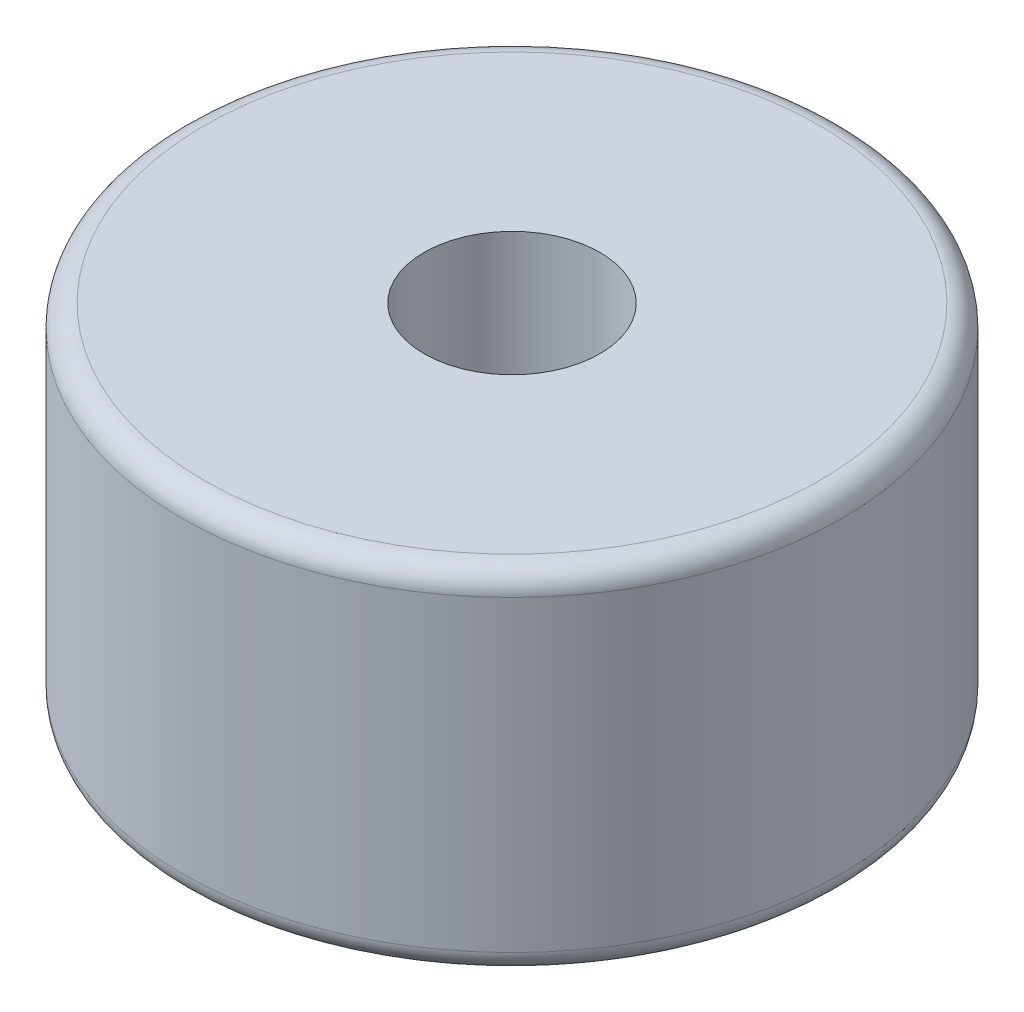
ISO-10303-21;
HEADER;
FILE_DESCRIPTION(('STEP AP214'),'2;1');
FILE_NAME('part.step','',(''),(''),'','','');
FILE_SCHEMA(('AUTOMOTIVE_DESIGN { 1 0 10303 214 1 1 1 1 }'));
ENDSEC;
DATA;
#1=APPLICATION_CONTEXT('core data for automotive mechanical design processes');
#2=APPLICATION_PROTOCOL_DEFINITION('international standard','automotive_design',2000,#1);
#3=PRODUCT_CONTEXT('',#1,'mechanical');
#4=PRODUCT('Part','Part','',(#3));
#5=PRODUCT_RELATED_PRODUCT_CATEGORY('part','',(#4));
#6=PRODUCT_DEFINITION_FORMATION('','',#4);
#7=PRODUCT_DEFINITION_CONTEXT('part definition',#1,'design');
#8=PRODUCT_DEFINITION('design','',#6,#7);
#9=PRODUCT_DEFINITION_SHAPE('','',#8);
#10=(LENGTH_UNIT() NAMED_UNIT(*) SI_UNIT(.MILLI.,.METRE.));
#11=(NAMED_UNIT(*) PLANE_ANGLE_UNIT() SI_UNIT($,.RADIAN.));
#12=(NAMED_UNIT(*) SI_UNIT($,.STERADIAN.) SOLID_ANGLE_UNIT());
#13=UNCERTAINTY_MEASURE_WITH_UNIT(LENGTH_MEASURE(1.E-05),#10,'distance_accuracy_value','');
#14=(GEOMETRIC_REPRESENTATION_CONTEXT(3) GLOBAL_UNCERTAINTY_ASSIGNED_CONTEXT((#13)) GLOBAL_UNIT_ASSIGNED_CONTEXT((#10,
#11,#12)) REPRESENTATION_CONTEXT('',''));
#15=CARTESIAN_POINT('',(0.,0.,0.));
#16=DIRECTION('',(0.,0.,1.));
#17=DIRECTION('',(1.,0.,0.));
#18=AXIS2_PLACEMENT_3D('',#15,#16,#17);
#19=CARTESIAN_POINT('',(0.,8.,0.));
#20=DIRECTION('',(0.,1.,0.));
#21=DIRECTION('',(0.,0.,1.));
#22=AXIS2_PLACEMENT_3D('',#19,#20,#21);
#23=PLANE('',#22);
#24=CARTESIAN_POINT('',(0.,8.,0.));
#25=DIRECTION('',(0.,1.,0.));
#26=DIRECTION('',(0.,0.,1.));
#27=AXIS2_PLACEMENT_3D('',#24,#25,#26);
#28=CIRCLE('',#27,7.);
#29=CARTESIAN_POINT('',(0.,8.,7.));
#30=VERTEX_POINT('',#29);
#31=EDGE_CURVE('E10',#30,#30,#28,.T.);
#32=ORIENTED_EDGE('',*,*,#31,.T.);
#33=EDGE_LOOP('',(#32));
#34=FACE_BOUND('',#33,.T.);
#35=CARTESIAN_POINT('',(0.,8.,0.));
#36=DIRECTION('',(0.,1.,0.));
#37=DIRECTION('',(0.,0.,1.));
#38=AXIS2_PLACEMENT_3D('',#35,#36,#37);
#39=CIRCLE('',#38,2.);
#40=CARTESIAN_POINT('',(0.,8.,2.));
#41=VERTEX_POINT('',#40);
#42=EDGE_CURVE('E61',#41,#41,#39,.T.);
#43=ORIENTED_EDGE('',*,*,#42,.F.);
#44=EDGE_LOOP('',(#43));
#45=FACE_BOUND('',#44,.T.);
#46=ADVANCED_FACE('F41',(#34,#45),#23,.T.);
#47=CARTESIAN_POINT('',(0.,0.,0.));
#48=DIRECTION('',(0.,1.,0.));
#49=DIRECTION('',(0.,0.,1.));
#50=AXIS2_PLACEMENT_3D('',#47,#48,#49);
#51=PLANE('',#50);
#52=CARTESIAN_POINT('',(0.,0.,0.));
#53=DIRECTION('',(0.,1.,0.));
#54=DIRECTION('',(0.,0.,1.));
#55=AXIS2_PLACEMENT_3D('',#52,#53,#54);
#56=CIRCLE('',#55,7.);
#57=CARTESIAN_POINT('',(0.,0.,7.));
#58=VERTEX_POINT('',#57);
#59=EDGE_CURVE('E48',#58,#58,#56,.F.);
#60=ORIENTED_EDGE('',*,*,#59,.T.);
#61=EDGE_LOOP('',(#60));
#62=FACE_BOUND('',#61,.T.);
#63=CARTESIAN_POINT('',(0.,0.,0.));
#64=DIRECTION('',(0.,1.,0.));
#65=DIRECTION('',(0.,0.,1.));
#66=AXIS2_PLACEMENT_3D('',#63,#64,#65);
#67=CIRCLE('',#66,2.);
#68=CARTESIAN_POINT('',(0.,0.,2.));
#69=VERTEX_POINT('',#68);
#70=EDGE_CURVE('E62',#69,#69,#67,.T.);
#71=ORIENTED_EDGE('',*,*,#70,.T.);
#72=EDGE_LOOP('',(#71));
#73=FACE_BOUND('',#72,.T.);
#74=ADVANCED_FACE('F72',(#62,#73),#51,.F.);
#75=CARTESIAN_POINT('',(0.,8.,0.));
#76=DIRECTION('',(0.,-1.,0.));
#77=DIRECTION('',(0.,0.,-1.));
#78=AXIS2_PLACEMENT_3D('',#75,#76,#77);
#79=CYLINDRICAL_SURFACE('',#78,7.5);
#80=CARTESIAN_POINT('',(0.,0.5,0.));
#81=DIRECTION('',(0.,1.,0.));
#82=DIRECTION('',(0.,0.,1.));
#83=AXIS2_PLACEMENT_3D('',#80,#81,#82);
#84=CIRCLE('',#83,7.5);
#85=CARTESIAN_POINT('',(0.,0.5,7.5));
#86=VERTEX_POINT('',#85);
#87=EDGE_CURVE('E52',#86,#86,#84,.T.);
#88=ORIENTED_EDGE('',*,*,#87,.T.);
#89=EDGE_LOOP('',(#88));
#90=FACE_BOUND('',#89,.T.);
#91=CARTESIAN_POINT('',(0.,7.5,0.));
#92=DIRECTION('',(0.,1.,0.));
#93=DIRECTION('',(0.,0.,1.));
#94=AXIS2_PLACEMENT_3D('',#91,#92,#93);
#95=CIRCLE('',#94,7.5);
#96=CARTESIAN_POINT('',(0.,7.5,7.5));
#97=VERTEX_POINT('',#96);
#98=EDGE_CURVE('E56',#97,#97,#95,.F.);
#99=ORIENTED_EDGE('',*,*,#98,.T.);
#100=EDGE_LOOP('',(#99));
#101=FACE_BOUND('',#100,.T.);
#102=ADVANCED_FACE('F77',(#90,#101),#79,.T.);
#103=CARTESIAN_POINT('',(0.,8.,0.));
#104=DIRECTION('',(0.,-1.,0.));
#105=DIRECTION('',(0.,0.,-1.));
#106=AXIS2_PLACEMENT_3D('',#103,#104,#105);
#107=CYLINDRICAL_SURFACE('',#106,2.);
#108=ORIENTED_EDGE('',*,*,#42,.T.);
#109=EDGE_LOOP('',(#108));
#110=FACE_BOUND('',#109,.T.);
#111=ORIENTED_EDGE('',*,*,#70,.F.);
#112=EDGE_LOOP('',(#111));
#113=FACE_BOUND('',#112,.T.);
#114=ADVANCED_FACE('F68',(#110,#113),#107,.F.);
#115=CARTESIAN_POINT('',(0.,0.5,0.));
#116=DIRECTION('',(0.,1.,0.));
#117=DIRECTION('',(0.,0.,1.));
#118=AXIS2_PLACEMENT_3D('',#115,#116,#117);
#119=TOROIDAL_SURFACE('',#118,7.,0.5);
#120=ORIENTED_EDGE('',*,*,#59,.F.);
#121=EDGE_LOOP('',(#120));
#122=FACE_BOUND('',#121,.T.);
#123=ORIENTED_EDGE('',*,*,#87,.F.);
#124=EDGE_LOOP('',(#123));
#125=FACE_BOUND('',#124,.T.);
#126=ADVANCED_FACE('F83',(#122,#125),#119,.T.);
#127=CARTESIAN_POINT('',(0.,7.5,0.));
#128=DIRECTION('',(0.,1.,0.));
#129=DIRECTION('',(0.,0.,1.));
#130=AXIS2_PLACEMENT_3D('',#127,#128,#129);
#131=TOROIDAL_SURFACE('',#130,7.,0.5);
#132=ORIENTED_EDGE('',*,*,#98,.F.);
#133=EDGE_LOOP('',(#132));
#134=FACE_BOUND('',#133,.T.);
#135=ORIENTED_EDGE('',*,*,#31,.F.);
#136=EDGE_LOOP('',(#135));
#137=FACE_BOUND('',#136,.T.);
#138=ADVANCED_FACE('F43',(#134,#137),#131,.T.);
#139=CLOSED_SHELL('',(#46,#74,#102,#114,#126,#138));
#140=MANIFOLD_SOLID_BREP('B2',#139);
#141=ADVANCED_BREP_SHAPE_REPRESENTATION('',(#18,#140),#14);
#142=SHAPE_DEFINITION_REPRESENTATION(#9,#141);
ENDSEC;
END-ISO-10303-21;
